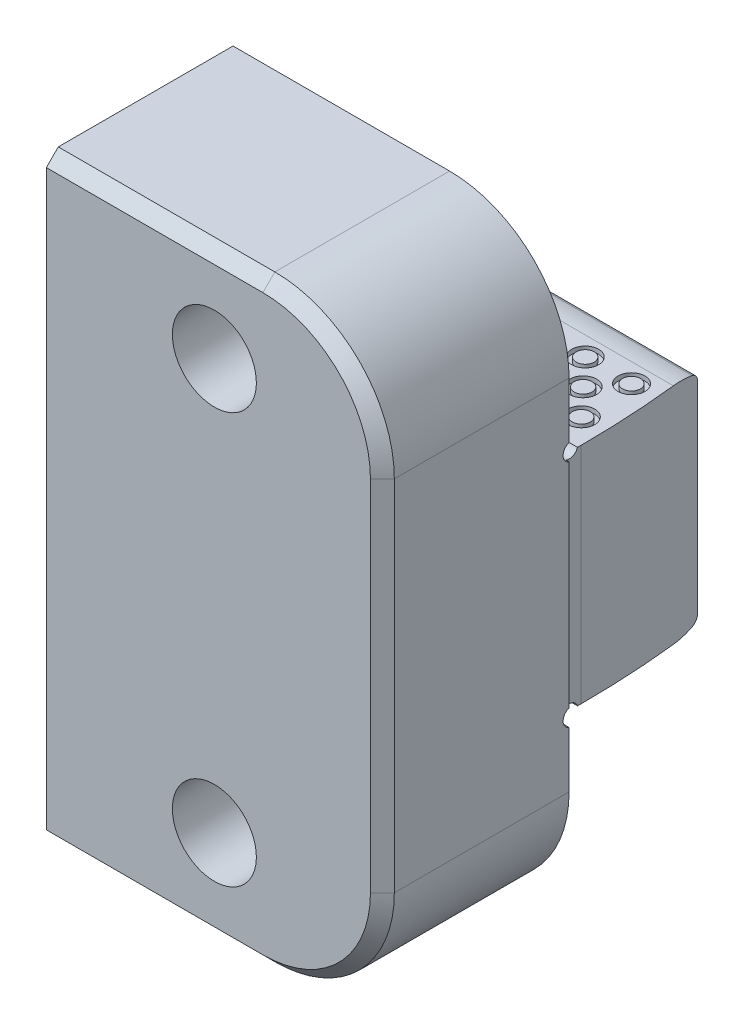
from build123d import *

# Parameters (mm, degrees)
EXTRUDE1_DEPTH             = 14.2875
SKETCH7_W                  = 21.968267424
SKETCH7_H                  = 31.720833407
CUT_EXTRUDE3_DEPTH         = 0.254
SKETCH8_R                  = 0.762
CUT_EXTRUDE4_DEPTH         = 42.396935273
CUT_EXTRUDE5_DEPTH         = 42.396935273
CUT_EXTRUDE6_DEPTH         = 56.107061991
SKETCH15_R                 = 1.143
SKETCH15_R_2               = 0.762
CUT_EXTRUDE7_DEPTH         = 0.381
F_1_4_20_CBORE_D           = 7.14248
F_1_4_20_CBORE_CBORE_D     = 11.1125
F_1_4_20_CBORE_CBORE_DEPTH = 7.14502
FILLET1_R                  = 10.16
CHAMFER1_SIZE              = 1.016


with BuildPart() as part:
    # Sketch3 → Extrude1 (new, symmetric)
    with BuildSketch(Plane(origin=(0, 0, 0), x_dir=(0, 0, -1), z_dir=(1, 0, 0))):
        Polygon((-15.875, -25.4), (0, -25.4), (0, -9.52246), (11.938, -9.52246), (11.938, 9.52246), (0, 9.52246), (0, 25.4), (-15.875, 25.4), align=None)
    extrude(amount=EXTRUDE1_DEPTH, both=True)

    # Sketch7 → Cut-Extrude3 (cut)
    with BuildSketch(Plane(origin=(14.2875, 0, 0), x_dir=(0, 0, -1), z_dir=(1, 0, 0))):
        with Locations((10.984133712, 1.307835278)):
            Rectangle(SKETCH7_W, SKETCH7_H)
    extrude(amount=-CUT_EXTRUDE3_DEPTH, mode=Mode.SUBTRACT)

    # Sketch8 → Cut-Extrude4 (cut, through all)
    with BuildSketch(Plane(origin=(14.2875, 0, 0), x_dir=(0, 0, -1), z_dir=(1, 0, 0))):
        with Locations((0.254, 9.77646)):
            Circle(SKETCH8_R)
        with Locations((0.254, -9.77646)):
            Circle(SKETCH8_R)
    extrude(amount=-CUT_EXTRUDE4_DEPTH, mode=Mode.SUBTRACT)

    # Sketch9 → Cut-Extrude5 (cut, through all)
    with BuildSketch(Plane(origin=(14.2875, 0, 0), x_dir=(0, 0, -1), z_dir=(1, 0, 0))):
        with BuildLine():
            Line((11.938, 8.526440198), (15.9258, 8.526440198))
            Line((15.9258, 8.526440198), (15.9258, 14.876440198))
            Line((15.9258, 14.876440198), (9.5758, 14.876440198))
            Line((9.5758, 14.876440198), (9.5758, 9.52246))
            ThreePointArc((9.5758, 9.52246), (10.49467584, 9.45562538), (11.394209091, 9.256528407))
            ThreePointArc((11.394209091, 9.256528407), (11.787113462, 8.981615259), (11.938, 8.526440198))
        make_face()
        with BuildLine():
            Line((15.9258, -8.526440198), (15.9258, -14.876440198))
            Line((15.9258, -14.876440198), (9.5758, -14.876440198))
            Line((9.5758, -14.876440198), (9.5758, -9.52246))
            ThreePointArc((9.5758, -9.52246), (10.49467584, -9.45562538), (11.394209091, -9.256528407))
            ThreePointArc((11.394209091, -9.256528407), (11.787113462, -8.981615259), (11.938, -8.526440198))
            Line((11.938, -8.526440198), (15.9258, -8.526440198))
        make_face()
    extrude(amount=-CUT_EXTRUDE5_DEPTH, mode=Mode.SUBTRACT)

    # Sketch13 → Cut-Extrude6 (cut, through all)
    with BuildSketch(Plane(origin=(0, 25.4, 0), x_dir=(1, 0, 0), z_dir=(0, 1, 0))):
        with BuildLine():
            Line((9.675548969, 26.67), (22.375548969, 26.67))
            Line((22.375548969, 26.67), (22.375548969, 1.27))
            Line((22.375548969, 1.27), (14.0335, 1.27))
            ThreePointArc((14.0335, 1.27), (12.936110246, 14.155570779), (9.675548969, 26.67))
        make_face()
    extrude(amount=-CUT_EXTRUDE6_DEPTH, mode=Mode.SUBTRACT)

    # Sketch15 → Cut-Extrude7 (cut)
    # profile 1 of 20: a face of its own
    with BuildSketch(Plane(origin=(0, 9.52246, 0), x_dir=(1, 0, 0), z_dir=(0, 1, 0))):
        with Locations(Location((-8.0391, 7.9502, 0), (0, 0, 270))):
            Circle(SKETCH15_R)
        with Locations(Location((-8.0391, 7.9502, 0), (0, 0, 270))):
            Circle(SKETCH15_R_2, mode=Mode.SUBTRACT)
    # profile 2 of 20: a face of its own
    with BuildSketch(Plane(origin=(0, 9.52246, 0), x_dir=(1, 0, 0), z_dir=(0, 1, 0))):
        with Locations(Location((-4.1021, 7.9502, 0), (0, 0, 270))):
            Circle(SKETCH15_R)
        with Locations(Location((-4.1021, 7.9502, 0), (0, 0, 270))):
            Circle(SKETCH15_R_2, mode=Mode.SUBTRACT)
    # profile 3 of 20: a face of its own
    with BuildSketch(Plane(origin=(0, 9.52246, 0), x_dir=(1, 0, 0), z_dir=(0, 1, 0))):
        with Locations(Location((-11.9761, 7.9502, 0), (0, 0, 270))):
            Circle(SKETCH15_R)
        with Locations(Location((-11.9761, 7.9502, 0), (0, 0, 270))):
            Circle(SKETCH15_R_2, mode=Mode.SUBTRACT)
    # profile 4 of 20: a face of its own
    with BuildSketch(Plane(origin=(0, 9.52246, 0), x_dir=(1, 0, 0), z_dir=(0, 1, 0))):
        with Locations(Location((-0.1651, 7.9502, 0), (0, 0, 270))):
            Circle(SKETCH15_R)
        with Locations(Location((-0.1651, 7.9502, 0), (0, 0, 270))):
            Circle(SKETCH15_R_2, mode=Mode.SUBTRACT)
    # profile 5 of 20: a face of its own
    with BuildSketch(Plane(origin=(0, 9.52246, 0), x_dir=(1, 0, 0), z_dir=(0, 1, 0))):
        with Locations(Location((3.7719, 7.9502, 0), (0, 0, 270))):
            Circle(SKETCH15_R)
        with Locations(Location((3.7719, 7.9502, 0), (0, 0, 270))):
            Circle(SKETCH15_R_2, mode=Mode.SUBTRACT)
    # profile 6 of 20: a face of its own
    with BuildSketch(Plane(origin=(0, 9.52246, 0), x_dir=(1, 0, 0), z_dir=(0, 1, 0))):
        with Locations(Location((11.6459, 7.9502, 0), (0, 0, 270))):
            Circle(SKETCH15_R)
        with Locations(Location((11.6459, 7.9502, 0), (0, 0, 270))):
            Circle(SKETCH15_R_2, mode=Mode.SUBTRACT)
    # profile 7 of 20: a face of its own
    with BuildSketch(Plane(origin=(0, 9.52246, 0), x_dir=(1, 0, 0), z_dir=(0, 1, 0))):
        with Locations(Location((7.7089, 7.9502, 0), (0, 0, 270))):
            Circle(SKETCH15_R)
        with Locations(Location((7.7089, 7.9502, 0), (0, 0, 270))):
            Circle(SKETCH15_R_2, mode=Mode.SUBTRACT)
    # profile 8 of 20: a face of its own
    with BuildSketch(Plane(origin=(0, 9.52246, 0), x_dir=(1, 0, 0), z_dir=(0, 1, 0))):
        with Locations(Location((-6.0325, 5.6642, 0), (0, 0, 270))):
            Circle(SKETCH15_R)
        with Locations(Location((-6.0325, 5.6642, 0), (0, 0, 270))):
            Circle(SKETCH15_R_2, mode=Mode.SUBTRACT)
    # profile 9 of 20: a face of its own
    with BuildSketch(Plane(origin=(0, 9.52246, 0), x_dir=(1, 0, 0), z_dir=(0, 1, 0))):
        with Locations(Location((-2.0701, 5.6642, 0), (0, 0, 270))):
            Circle(SKETCH15_R)
        with Locations(Location((-2.0701, 5.6642, 0), (0, 0, 270))):
            Circle(SKETCH15_R_2, mode=Mode.SUBTRACT)
    # profile 10 of 20: a face of its own
    with BuildSketch(Plane(origin=(0, 9.52246, 0), x_dir=(1, 0, 0), z_dir=(0, 1, 0))):
        with Locations(Location((-9.9949, 5.6642, 0), (0, 0, 270))):
            Circle(SKETCH15_R)
        with Locations(Location((-9.9949, 5.6642, 0), (0, 0, 270))):
            Circle(SKETCH15_R_2, mode=Mode.SUBTRACT)
    # profile 11 of 20: a face of its own
    with BuildSketch(Plane(origin=(0, 9.52246, 0), x_dir=(1, 0, 0), z_dir=(0, 1, 0))):
        with Locations(Location((1.8923, 5.6642, 0), (0, 0, 270))):
            Circle(SKETCH15_R)
        with Locations(Location((1.8923, 5.6642, 0), (0, 0, 270))):
            Circle(SKETCH15_R_2, mode=Mode.SUBTRACT)
    # profile 12 of 20: a face of its own
    with BuildSketch(Plane(origin=(0, 9.52246, 0), x_dir=(1, 0, 0), z_dir=(0, 1, 0))):
        with Locations(Location((5.8547, 5.6642, 0), (0, 0, 270))):
            Circle(SKETCH15_R)
        with Locations(Location((5.8547, 5.6642, 0), (0, 0, 270))):
            Circle(SKETCH15_R_2, mode=Mode.SUBTRACT)
    # profile 13 of 20: a face of its own
    with BuildSketch(Plane(origin=(0, 9.52246, 0), x_dir=(1, 0, 0), z_dir=(0, 1, 0))):
        with Locations(Location((9.8171, 5.6642, 0), (0, 0, 270))):
            Circle(SKETCH15_R)
        with Locations(Location((9.8171, 5.6642, 0), (0, 0, 270))):
            Circle(SKETCH15_R_2, mode=Mode.SUBTRACT)
    # profile 14 of 20: a face of its own
    with BuildSketch(Plane(origin=(0, 9.52246, 0), x_dir=(1, 0, 0), z_dir=(0, 1, 0))):
        with Locations(Location((-7.9883, 3.3782, 0), (0, 0, 270))):
            Circle(SKETCH15_R)
        with Locations(Location((-7.9883, 3.3782, 0), (0, 0, 270))):
            Circle(SKETCH15_R_2, mode=Mode.SUBTRACT)
    # profile 15 of 20: a face of its own
    with BuildSketch(Plane(origin=(0, 9.52246, 0), x_dir=(1, 0, 0), z_dir=(0, 1, 0))):
        with Locations(Location((-4.0005, 3.3782, 0), (0, 0, 270))):
            Circle(SKETCH15_R)
        with Locations(Location((-4.0005, 3.3782, 0), (0, 0, 270))):
            Circle(SKETCH15_R_2, mode=Mode.SUBTRACT)
    # profile 16 of 20: a face of its own
    with BuildSketch(Plane(origin=(0, 9.52246, 0), x_dir=(1, 0, 0), z_dir=(0, 1, 0))):
        with Locations(Location((-11.9761, 3.3782, 0), (0, 0, 270))):
            Circle(SKETCH15_R)
        with Locations(Location((-11.9761, 3.3782, 0), (0, 0, 270))):
            Circle(SKETCH15_R_2, mode=Mode.SUBTRACT)
    # profile 17 of 20: a face of its own
    with BuildSketch(Plane(origin=(0, 9.52246, 0), x_dir=(1, 0, 0), z_dir=(0, 1, 0))):
        with Locations(Location((-0.0127, 3.3782, 0), (0, 0, 270))):
            Circle(SKETCH15_R)
        with Locations(Location((-0.0127, 3.3782, 0), (0, 0, 270))):
            Circle(SKETCH15_R_2, mode=Mode.SUBTRACT)
    # profile 18 of 20: a face of its own
    with BuildSketch(Plane(origin=(0, 9.52246, 0), x_dir=(1, 0, 0), z_dir=(0, 1, 0))):
        with Locations(Location((3.9751, 3.3782, 0), (0, 0, 270))):
            Circle(SKETCH15_R)
        with Locations(Location((3.9751, 3.3782, 0), (0, 0, 270))):
            Circle(SKETCH15_R_2, mode=Mode.SUBTRACT)
    # profile 19 of 20: a face of its own
    with BuildSketch(Plane(origin=(0, 9.52246, 0), x_dir=(1, 0, 0), z_dir=(0, 1, 0))):
        with Locations(Location((11.9507, 3.3782, 0), (0, 0, 270))):
            Circle(SKETCH15_R)
        with Locations(Location((11.9507, 3.3782, 0), (0, 0, 270))):
            Circle(SKETCH15_R_2, mode=Mode.SUBTRACT)
    # profile 20 of 20: a face of its own
    with BuildSketch(Plane(origin=(0, 9.52246, 0), x_dir=(1, 0, 0), z_dir=(0, 1, 0))):
        with Locations(Location((7.9629, 3.3782, 0), (0, 0, 270))):
            Circle(SKETCH15_R)
        with Locations(Location((7.9629, 3.3782, 0), (0, 0, 270))):
            Circle(SKETCH15_R_2, mode=Mode.SUBTRACT)
    cut_extrude7 = extrude(amount=-CUT_EXTRUDE7_DEPTH, mode=Mode.SUBTRACT)

    # Mirror1: Cut-Extrude7 across plane
    add(cut_extrude7.mirror(Plane.ZX), mode=Mode.SUBTRACT)

    # 1_4_-20 CBORE (through all)
    with Locations(Plane(origin=(0, 0, 0), x_dir=(-1, 0, 0), z_dir=(0, 0, -1))):
        with Locations((0, 17.4625), (0, -17.4625)):
            CounterBoreHole(F_1_4_20_CBORE_D / 2, F_1_4_20_CBORE_CBORE_D / 2, F_1_4_20_CBORE_CBORE_DEPTH)

    # Fillet1
    fillet1_edges = [part.edges().sort_by_distance(p)[0] for p in [
        (14.2875, 25.4, 7.9375),
        (14.2875, -25.4, 7.9375),
    ]]
    fillet(fillet1_edges, radius=FILLET1_R)

    # Chamfer1
    chamfer1_edges = [part.edges().sort_by_distance(p)[0] for p in [
        (14.2875, 0, 15.875),
        (-5.08, -25.4, 15.875),
        (-5.08, 25.4, 15.875),
        (11.311704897, 22.424204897, 15.875),
        (11.311704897, -22.424204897, 15.875),
    ]]
    chamfer(chamfer1_edges, length=CHAMFER1_SIZE)


solid = part.part
